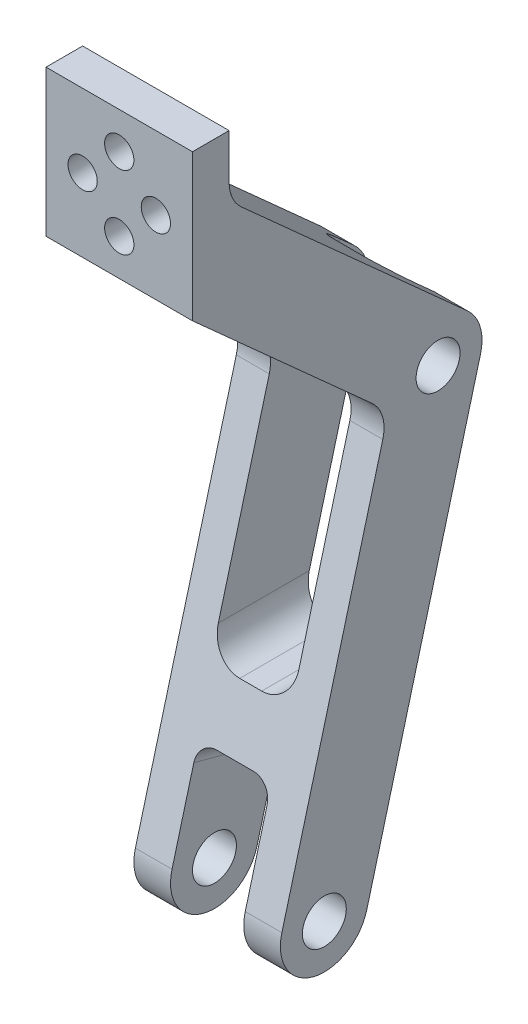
from build123d import *

# Parameters (mm, degrees)
SKETCH1_R               = 3
BOSS_EXTRUDE1_DEPTH     = 10
FILLET1_R               = 5
CUT_EXTRUDE1_DEPTH      = 20
CUT_EXTRUDE2_DEPTH      = 108.993301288
CUT_EXTRUDE2_DEPTH_BACK = 108.993301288
SKETCH3_R               = 2
SKETCH3_W               = 11
SKETCH3_H               = 45
FILLET2_R               = 4


with BuildPart() as part:
    # Sketch1 → Boss-Extrude1 (new, symmetric)
    with BuildSketch(Plane(origin=(0, 0, 0), x_dir=(0, 0, -1), z_dir=(1, 0, 0))):
        with BuildLine():
            Line((5.795554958, -1.552914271), (21.324697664, 56.402635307))
            ThreePointArc((21.324697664, 56.402635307), (21.280918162, 59.663495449), (19.537948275, 62.419793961))
            Line((19.537948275, 62.419793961), (-13, 91.638245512))
            Line((-13, 91.638245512), (-13, 100))
            Line((-13, 100), (-18, 100))
            Line((-18, 100), (-18, 80))
            Line((-18, 80), (8.780529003, 55.951600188))
            Line((8.780529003, 55.951600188), (-5.795554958, 1.552914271))
            ThreePointArc((-5.795554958, 1.552914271), (-1.552914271, -5.795554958), (5.795554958, -1.552914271))
        make_face()
        Circle(SKETCH1_R, mode=Mode.SUBTRACT)
        with Locations((15.529142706, 57.955549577)):
            Circle(SKETCH1_R, mode=Mode.SUBTRACT)
    extrude(amount=BOSS_EXTRUDE1_DEPTH, both=True)

    # Fillet1
    fillet1_edges = [part.edges().sort_by_distance(p)[0] for p in [
        (0, 55.951600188, -8.780529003),
        (0, 91.638245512, 13),
    ]]
    fillet(fillet1_edges, radius=FILLET1_R)

    # Sketch2 → Cut-Extrude1 (cut)
    with BuildSketch(Plane(origin=(0, -1.552914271, -5.795554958), x_dir=(-1, 0, 0), z_dir=(0, -0.25881904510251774, -0.9659258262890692))):
        with BuildLine():
            Line((5, -6), (-5, -6))
            Line((-5, -6), (-5, 11.5))
            ThreePointArc((-5, 11.5), (-4.267766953, 13.267766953), (-2.5, 14))
            Line((-2.5, 14), (2.5, 14))
            ThreePointArc((2.5, 14), (4.267766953, 13.267766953), (5, 11.5))
            Line((5, 11.5), (5, -6))
        make_face()
    extrude(amount=-CUT_EXTRUDE1_DEPTH, mode=Mode.SUBTRACT)

    # Sketch3 → Cut-Extrude2 (cut, two sides: drawn at the far end of the back side and taken through both)
    with BuildSketch(Plane.XY.offset(18).offset(-CUT_EXTRUDE2_DEPTH_BACK)):
        with Locations(Location((0, 95, 0), (0, 0, 325.542273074))):
            Circle(SKETCH3_R)
        with Locations(Location((-5, 90, 0), (0, 0, 4.249519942))):
            Circle(SKETCH3_R)
        with Locations(Location((0, 85, 0), (0, 0, 90))):
            Circle(SKETCH3_R)
        with Locations(Location((5, 90, 0), (0, 0, 4.249519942))):
            Circle(SKETCH3_R)
        with Locations((0, 45.5)):
            Rectangle(SKETCH3_W, SKETCH3_H)
    extrude(amount=CUT_EXTRUDE2_DEPTH + CUT_EXTRUDE2_DEPTH_BACK, mode=Mode.SUBTRACT)

    # Fillet2
    fillet2_edges = [part.edges().sort_by_distance(p)[0] for p in [
        (-5.5, 68, -4.343546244),
        (5.5, 23, -6.162831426),
        (-5.5, 23, -6.162831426),
        (5.5, 68, -4.343546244),
    ]]
    fillet(fillet2_edges, radius=FILLET2_R)


solid = part.part
